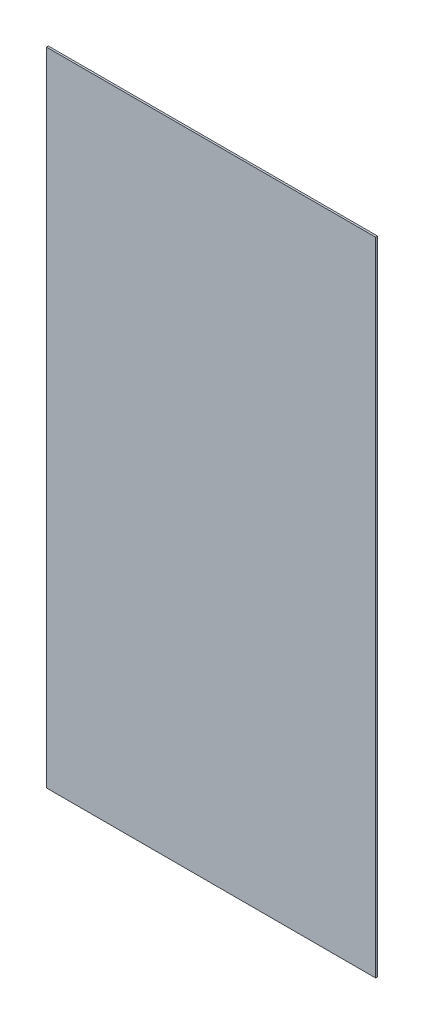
from build123d import *

# Parameters (mm, degrees)
ESBO_O1_W                = 1026
ESBO_O1_H                = 2000
RESSALTO_EXTRUS_O1_DEPTH = 6


with BuildPart() as part:
    # Esbo_o1 → Ressalto-extrus_o1 (new body)
    with BuildSketch(Plane.XY):
        with Locations((513, 0)):
            Rectangle(ESBO_O1_W, ESBO_O1_H)
    extrude(amount=RESSALTO_EXTRUS_O1_DEPTH)


solid = part.part
